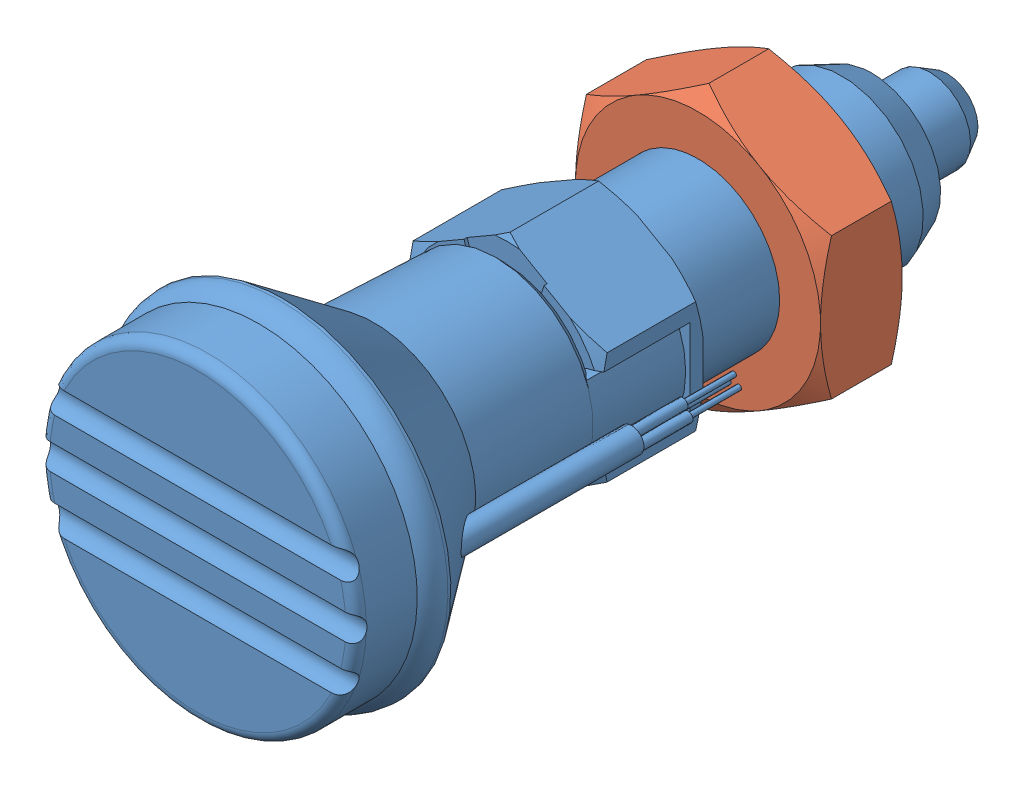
SolidWorks assembly NDX16LW-S-SUS.sldasm, configuration Default (file format 15000). Lengths in mm.
Overall size (33 33 74).
2 component instances, 2 part files, 0 mates.
Components (placement in the parent):
- NDX16LW-S-SUS_01-1: NDX16LW-S-SUS_01.sldprt [ﾃﾞﾌｫﾙﾄ] at origin size (33 33 74)
- NDX16LW-S-SUS_02-1: NDX16LW-S-SUS_02.sldprt [ﾃﾞﾌｫﾙﾄ] at origin size (32.79 32.79 8.01)
